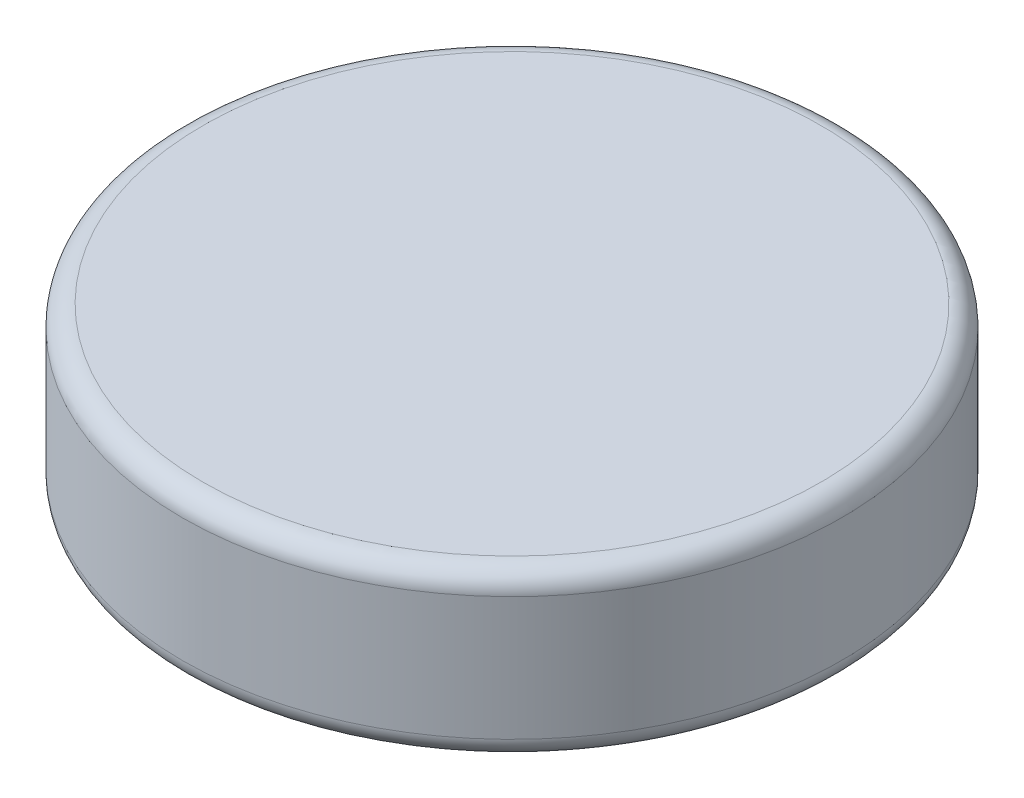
ISO-10303-21;
HEADER;
FILE_DESCRIPTION(('STEP AP214'),'2;1');
FILE_NAME('part.step','',(''),(''),'','','');
FILE_SCHEMA(('AUTOMOTIVE_DESIGN { 1 0 10303 214 1 1 1 1 }'));
ENDSEC;
DATA;
#1=APPLICATION_CONTEXT('core data for automotive mechanical design processes');
#2=APPLICATION_PROTOCOL_DEFINITION('international standard','automotive_design',2000,#1);
#3=PRODUCT_CONTEXT('',#1,'mechanical');
#4=PRODUCT('Part','Part','',(#3));
#5=PRODUCT_RELATED_PRODUCT_CATEGORY('part','',(#4));
#6=PRODUCT_DEFINITION_FORMATION('','',#4);
#7=PRODUCT_DEFINITION_CONTEXT('part definition',#1,'design');
#8=PRODUCT_DEFINITION('design','',#6,#7);
#9=PRODUCT_DEFINITION_SHAPE('','',#8);
#10=(LENGTH_UNIT() NAMED_UNIT(*) SI_UNIT(.MILLI.,.METRE.));
#11=(NAMED_UNIT(*) PLANE_ANGLE_UNIT() SI_UNIT($,.RADIAN.));
#12=(NAMED_UNIT(*) SI_UNIT($,.STERADIAN.) SOLID_ANGLE_UNIT());
#13=UNCERTAINTY_MEASURE_WITH_UNIT(LENGTH_MEASURE(1.E-05),#10,'distance_accuracy_value','');
#14=(GEOMETRIC_REPRESENTATION_CONTEXT(3) GLOBAL_UNCERTAINTY_ASSIGNED_CONTEXT((#13)) GLOBAL_UNIT_ASSIGNED_CONTEXT((#10,
#11,#12)) REPRESENTATION_CONTEXT('',''));
#15=CARTESIAN_POINT('',(0.,0.,0.));
#16=DIRECTION('',(0.,0.,1.));
#17=DIRECTION('',(1.,0.,0.));
#18=AXIS2_PLACEMENT_3D('',#15,#16,#17);
#19=CARTESIAN_POINT('',(0.,2.032,0.));
#20=DIRECTION('',(0.,-1.,0.));
#21=DIRECTION('',(0.,0.,-1.));
#22=AXIS2_PLACEMENT_3D('',#19,#20,#21);
#23=CYLINDRICAL_SURFACE('',#22,4.064);
#24=CARTESIAN_POINT('',(0.,0.254,0.));
#25=DIRECTION('',(0.,1.,0.));
#26=DIRECTION('',(0.,0.,1.));
#27=AXIS2_PLACEMENT_3D('',#24,#25,#26);
#28=CIRCLE('',#27,4.064);
#29=CARTESIAN_POINT('',(0.,0.254,4.064));
#30=VERTEX_POINT('',#29);
#31=EDGE_CURVE('E50',#30,#30,#28,.T.);
#32=ORIENTED_EDGE('',*,*,#31,.T.);
#33=EDGE_LOOP('',(#32));
#34=FACE_BOUND('',#33,.T.);
#35=CARTESIAN_POINT('',(0.,1.778,0.));
#36=DIRECTION('',(0.,1.,0.));
#37=DIRECTION('',(0.,0.,1.));
#38=AXIS2_PLACEMENT_3D('',#35,#36,#37);
#39=CIRCLE('',#38,4.064);
#40=CARTESIAN_POINT('',(0.,1.778,4.064));
#41=VERTEX_POINT('',#40);
#42=EDGE_CURVE('E55',#41,#41,#39,.F.);
#43=ORIENTED_EDGE('',*,*,#42,.T.);
#44=EDGE_LOOP('',(#43));
#45=FACE_BOUND('',#44,.T.);
#46=ADVANCED_FACE('F37',(#34,#45),#23,.T.);
#47=CARTESIAN_POINT('',(0.,2.032,0.));
#48=DIRECTION('',(0.,1.,0.));
#49=DIRECTION('',(0.,0.,1.));
#50=AXIS2_PLACEMENT_3D('',#47,#48,#49);
#51=PLANE('',#50);
#52=CARTESIAN_POINT('',(0.,2.032,0.));
#53=DIRECTION('',(0.,1.,0.));
#54=DIRECTION('',(0.,0.,1.));
#55=AXIS2_PLACEMENT_3D('',#52,#53,#54);
#56=CIRCLE('',#55,3.81);
#57=CARTESIAN_POINT('',(0.,2.032,3.81));
#58=VERTEX_POINT('',#57);
#59=EDGE_CURVE('E10',#58,#58,#56,.T.);
#60=ORIENTED_EDGE('',*,*,#59,.T.);
#61=EDGE_LOOP('',(#60));
#62=FACE_BOUND('',#61,.T.);
#63=ADVANCED_FACE('F72',(#62),#51,.T.);
#64=CARTESIAN_POINT('',(0.,0.,0.));
#65=DIRECTION('',(0.,1.,0.));
#66=DIRECTION('',(0.,0.,1.));
#67=AXIS2_PLACEMENT_3D('',#64,#65,#66);
#68=PLANE('',#67);
#69=CARTESIAN_POINT('',(0.,0.,0.));
#70=DIRECTION('',(0.,1.,0.));
#71=DIRECTION('',(0.,0.,1.));
#72=AXIS2_PLACEMENT_3D('',#69,#70,#71);
#73=CIRCLE('',#72,3.81);
#74=CARTESIAN_POINT('',(0.,0.,3.81));
#75=VERTEX_POINT('',#74);
#76=EDGE_CURVE('E45',#75,#75,#73,.F.);
#77=ORIENTED_EDGE('',*,*,#76,.T.);
#78=EDGE_LOOP('',(#77));
#79=FACE_BOUND('',#78,.T.);
#80=ADVANCED_FACE('F69',(#79),#68,.F.);
#81=CARTESIAN_POINT('',(0.,0.254,0.));
#82=DIRECTION('',(0.,1.,0.));
#83=DIRECTION('',(0.,0.,1.));
#84=AXIS2_PLACEMENT_3D('',#81,#82,#83);
#85=TOROIDAL_SURFACE('',#84,3.81,0.254);
#86=ORIENTED_EDGE('',*,*,#76,.F.);
#87=EDGE_LOOP('',(#86));
#88=FACE_BOUND('',#87,.T.);
#89=ORIENTED_EDGE('',*,*,#31,.F.);
#90=EDGE_LOOP('',(#89));
#91=FACE_BOUND('',#90,.T.);
#92=ADVANCED_FACE('F65',(#88,#91),#85,.T.);
#93=CARTESIAN_POINT('',(0.,1.778,0.));
#94=DIRECTION('',(0.,1.,0.));
#95=DIRECTION('',(0.,0.,1.));
#96=AXIS2_PLACEMENT_3D('',#93,#94,#95);
#97=TOROIDAL_SURFACE('',#96,3.81,0.254);
#98=ORIENTED_EDGE('',*,*,#42,.F.);
#99=EDGE_LOOP('',(#98));
#100=FACE_BOUND('',#99,.T.);
#101=ORIENTED_EDGE('',*,*,#59,.F.);
#102=EDGE_LOOP('',(#101));
#103=FACE_BOUND('',#102,.T.);
#104=ADVANCED_FACE('F39',(#100,#103),#97,.T.);
#105=CLOSED_SHELL('',(#46,#63,#80,#92,#104));
#106=MANIFOLD_SOLID_BREP('B2',#105);
#107=ADVANCED_BREP_SHAPE_REPRESENTATION('',(#18,#106),#14);
#108=SHAPE_DEFINITION_REPRESENTATION(#9,#107);
ENDSEC;
END-ISO-10303-21;
